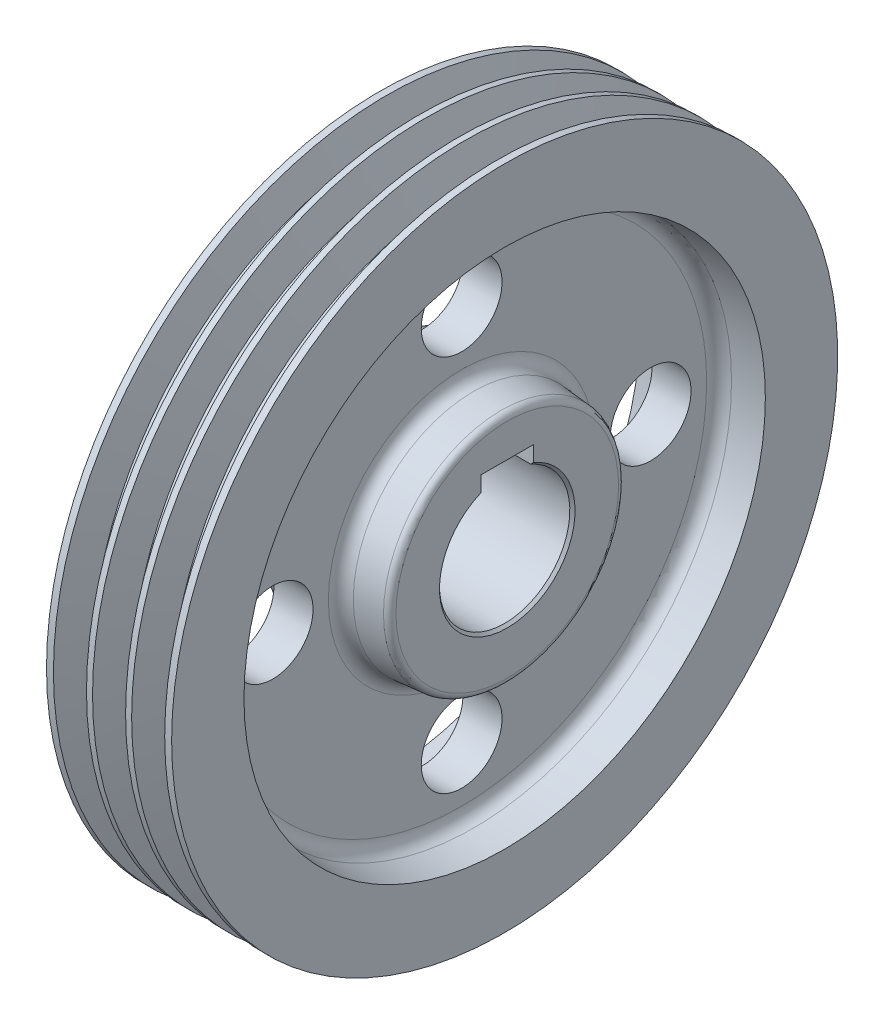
ISO-10303-21;
HEADER;
FILE_DESCRIPTION(('STEP AP214'),'2;1');
FILE_NAME('part.step','',(''),(''),'','','');
FILE_SCHEMA(('AUTOMOTIVE_DESIGN { 1 0 10303 214 1 1 1 1 }'));
ENDSEC;
DATA;
#1=APPLICATION_CONTEXT('core data for automotive mechanical design processes');
#2=APPLICATION_PROTOCOL_DEFINITION('international standard','automotive_design',2000,#1);
#3=PRODUCT_CONTEXT('',#1,'mechanical');
#4=PRODUCT('Part','Part','',(#3));
#5=PRODUCT_RELATED_PRODUCT_CATEGORY('part','',(#4));
#6=PRODUCT_DEFINITION_FORMATION('','',#4);
#7=PRODUCT_DEFINITION_CONTEXT('part definition',#1,'design');
#8=PRODUCT_DEFINITION('design','',#6,#7);
#9=PRODUCT_DEFINITION_SHAPE('','',#8);
#10=(LENGTH_UNIT() NAMED_UNIT(*) SI_UNIT(.MILLI.,.METRE.));
#11=(NAMED_UNIT(*) PLANE_ANGLE_UNIT() SI_UNIT($,.RADIAN.));
#12=(NAMED_UNIT(*) SI_UNIT($,.STERADIAN.) SOLID_ANGLE_UNIT());
#13=UNCERTAINTY_MEASURE_WITH_UNIT(LENGTH_MEASURE(1.E-05),#10,'distance_accuracy_value','');
#14=(GEOMETRIC_REPRESENTATION_CONTEXT(3) GLOBAL_UNCERTAINTY_ASSIGNED_CONTEXT((#13)) GLOBAL_UNIT_ASSIGNED_CONTEXT((#10,
#11,#12)) REPRESENTATION_CONTEXT('',''));
#15=CARTESIAN_POINT('',(0.,0.,0.));
#16=DIRECTION('',(0.,0.,1.));
#17=DIRECTION('',(1.,0.,0.));
#18=AXIS2_PLACEMENT_3D('',#15,#16,#17);
#19=CARTESIAN_POINT('',(16.5,46.5310516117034,0.));
#20=DIRECTION('',(1.,0.,0.));
#21=DIRECTION('',(0.,0.,-1.));
#22=AXIS2_PLACEMENT_3D('',#19,#20,#21);
#23=PLANE('',#22);
#24=CARTESIAN_POINT('',(16.5,-72.5,5.06265087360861E-13));
#25=DIRECTION('',(1.,0.,0.));
#26=DIRECTION('',(0.,0.,-1.));
#27=AXIS2_PLACEMENT_3D('',#24,#25,#26);
#28=CIRCLE('',#27,15.5);
#29=CARTESIAN_POINT('',(16.5,-72.5,-15.4999999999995));
#30=VERTEX_POINT('',#29);
#31=EDGE_CURVE('E327',#30,#30,#28,.F.);
#32=ORIENTED_EDGE('',*,*,#31,.F.);
#33=EDGE_LOOP('',(#32));
#34=FACE_BOUND('',#33,.T.);
#35=CARTESIAN_POINT('',(16.5,72.5,0.));
#36=DIRECTION('',(1.,0.,0.));
#37=DIRECTION('',(0.,0.,-1.));
#38=AXIS2_PLACEMENT_3D('',#35,#36,#37);
#39=CIRCLE('',#38,15.5);
#40=CARTESIAN_POINT('',(16.5,72.5,-15.5));
#41=VERTEX_POINT('',#40);
#42=EDGE_CURVE('E113',#41,#41,#39,.F.);
#43=ORIENTED_EDGE('',*,*,#42,.F.);
#44=EDGE_LOOP('',(#43));
#45=FACE_BOUND('',#44,.T.);
#46=CARTESIAN_POINT('',(16.5,0.,0.));
#47=DIRECTION('',(1.,0.,0.));
#48=DIRECTION('',(0.,0.,-1.));
#49=AXIS2_PLACEMENT_3D('',#46,#47,#48);
#50=CIRCLE('',#49,51.1127074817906);
#51=CARTESIAN_POINT('',(16.5,0.,-51.1127074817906));
#52=VERTEX_POINT('',#51);
#53=EDGE_CURVE('E293',#52,#52,#50,.T.);
#54=ORIENTED_EDGE('',*,*,#53,.T.);
#55=EDGE_LOOP('',(#54));
#56=FACE_BOUND('',#55,.T.);
#57=CARTESIAN_POINT('',(16.5,0.,0.));
#58=DIRECTION('',(1.,0.,0.));
#59=DIRECTION('',(0.,0.,-1.));
#60=AXIS2_PLACEMENT_3D('',#57,#58,#59);
#61=CIRCLE('',#60,93.9747811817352);
#62=CARTESIAN_POINT('',(16.5,0.,-93.9747811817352));
#63=VERTEX_POINT('',#62);
#64=EDGE_CURVE('E289',#63,#63,#61,.F.);
#65=ORIENTED_EDGE('',*,*,#64,.T.);
#66=EDGE_LOOP('',(#65));
#67=FACE_BOUND('',#66,.T.);
#68=CARTESIAN_POINT('',(16.5,-2.5313254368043E-13,-72.5));
#69=DIRECTION('',(1.,0.,0.));
#70=DIRECTION('',(0.,0.,-1.));
#71=AXIS2_PLACEMENT_3D('',#68,#69,#70);
#72=CIRCLE('',#71,15.5);
#73=CARTESIAN_POINT('',(16.5,-2.5313254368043E-13,-88.));
#74=VERTEX_POINT('',#73);
#75=EDGE_CURVE('E324',#74,#74,#72,.F.);
#76=ORIENTED_EDGE('',*,*,#75,.F.);
#77=EDGE_LOOP('',(#76));
#78=FACE_BOUND('',#77,.T.);
#79=CARTESIAN_POINT('',(16.5,7.59397631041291E-13,72.5));
#80=DIRECTION('',(1.,0.,0.));
#81=DIRECTION('',(0.,0.,-1.));
#82=AXIS2_PLACEMENT_3D('',#79,#80,#81);
#83=CIRCLE('',#82,15.5);
#84=CARTESIAN_POINT('',(16.5,7.59397631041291E-13,57.));
#85=VERTEX_POINT('',#84);
#86=EDGE_CURVE('E330',#85,#85,#83,.F.);
#87=ORIENTED_EDGE('',*,*,#86,.F.);
#88=EDGE_LOOP('',(#87));
#89=FACE_BOUND('',#88,.T.);
#90=ADVANCED_FACE('F30',(#34,#45,#56,#67,#78,#89),#23,.F.);
#91=CARTESIAN_POINT('',(31.5,98.5564370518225,0.));
#92=DIRECTION('',(-1.,0.,0.));
#93=DIRECTION('',(0.,0.,1.));
#94=AXIS2_PLACEMENT_3D('',#91,#92,#93);
#95=PLANE('',#94);
#96=CARTESIAN_POINT('',(31.5,-72.5,5.06265087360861E-13));
#97=DIRECTION('',(-1.,0.,0.));
#98=DIRECTION('',(0.,0.,1.));
#99=AXIS2_PLACEMENT_3D('',#96,#97,#98);
#100=CIRCLE('',#99,15.5);
#101=CARTESIAN_POINT('',(31.5,-72.5,15.5000000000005));
#102=VERTEX_POINT('',#101);
#103=EDGE_CURVE('E328',#102,#102,#100,.F.);
#104=ORIENTED_EDGE('',*,*,#103,.F.);
#105=EDGE_LOOP('',(#104));
#106=FACE_BOUND('',#105,.T.);
#107=CARTESIAN_POINT('',(31.5,72.5,0.));
#108=DIRECTION('',(-1.,0.,0.));
#109=DIRECTION('',(0.,0.,1.));
#110=AXIS2_PLACEMENT_3D('',#107,#108,#109);
#111=CIRCLE('',#110,15.5);
#112=CARTESIAN_POINT('',(31.5,72.5,15.5));
#113=VERTEX_POINT('',#112);
#114=EDGE_CURVE('E321',#113,#113,#111,.F.);
#115=ORIENTED_EDGE('',*,*,#114,.F.);
#116=EDGE_LOOP('',(#115));
#117=FACE_BOUND('',#116,.T.);
#118=CARTESIAN_POINT('',(31.5,0.,0.));
#119=DIRECTION('',(-1.,0.,0.));
#120=DIRECTION('',(0.,0.,1.));
#121=AXIS2_PLACEMENT_3D('',#118,#119,#120);
#122=CIRCLE('',#121,51.1127074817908);
#123=CARTESIAN_POINT('',(31.5,0.,51.1127074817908));
#124=VERTEX_POINT('',#123);
#125=EDGE_CURVE('E304',#124,#124,#122,.T.);
#126=ORIENTED_EDGE('',*,*,#125,.T.);
#127=EDGE_LOOP('',(#126));
#128=FACE_BOUND('',#127,.T.);
#129=CARTESIAN_POINT('',(31.5,0.,0.));
#130=DIRECTION('',(-1.,0.,0.));
#131=DIRECTION('',(0.,0.,1.));
#132=AXIS2_PLACEMENT_3D('',#129,#130,#131);
#133=CIRCLE('',#132,93.9747811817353);
#134=CARTESIAN_POINT('',(31.5,0.,93.9747811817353));
#135=VERTEX_POINT('',#134);
#136=EDGE_CURVE('E301',#135,#135,#133,.F.);
#137=ORIENTED_EDGE('',*,*,#136,.T.);
#138=EDGE_LOOP('',(#137));
#139=FACE_BOUND('',#138,.T.);
#140=CARTESIAN_POINT('',(31.5,-2.5313254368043E-13,-72.5));
#141=DIRECTION('',(-1.,0.,0.));
#142=DIRECTION('',(0.,0.,1.));
#143=AXIS2_PLACEMENT_3D('',#140,#141,#142);
#144=CIRCLE('',#143,15.5);
#145=CARTESIAN_POINT('',(31.5,-2.5313254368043E-13,-57.));
#146=VERTEX_POINT('',#145);
#147=EDGE_CURVE('E325',#146,#146,#144,.F.);
#148=ORIENTED_EDGE('',*,*,#147,.F.);
#149=EDGE_LOOP('',(#148));
#150=FACE_BOUND('',#149,.T.);
#151=CARTESIAN_POINT('',(31.5,7.59397631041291E-13,72.5));
#152=DIRECTION('',(-1.,0.,0.));
#153=DIRECTION('',(0.,0.,1.));
#154=AXIS2_PLACEMENT_3D('',#151,#152,#153);
#155=CIRCLE('',#154,15.5);
#156=CARTESIAN_POINT('',(31.5,7.59397631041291E-13,88.));
#157=VERTEX_POINT('',#156);
#158=EDGE_CURVE('E34',#157,#157,#155,.F.);
#159=ORIENTED_EDGE('',*,*,#158,.F.);
#160=EDGE_LOOP('',(#159));
#161=FACE_BOUND('',#160,.T.);
#162=ADVANCED_FACE('F190',(#106,#117,#128,#139,#150,#161),#95,.F.);
#163=CARTESIAN_POINT('',(0.,0.,0.));
#164=DIRECTION('',(-1.,0.,0.));
#165=DIRECTION('',(0.,0.,1.));
#166=AXIS2_PLACEMENT_3D('',#163,#164,#165);
#167=CYLINDRICAL_SURFACE('',#166,127.75);
#168=CARTESIAN_POINT('',(48.,0.,0.));
#169=DIRECTION('',(-1.,0.,0.));
#170=DIRECTION('',(0.,0.,1.));
#171=AXIS2_PLACEMENT_3D('',#168,#169,#170);
#172=CIRCLE('',#171,127.75);
#173=CARTESIAN_POINT('',(48.,0.,127.75));
#174=VERTEX_POINT('',#173);
#175=EDGE_CURVE('E242',#174,#174,#172,.T.);
#176=ORIENTED_EDGE('',*,*,#175,.T.);
#177=EDGE_LOOP('',(#176));
#178=FACE_BOUND('',#177,.T.);
#179=CARTESIAN_POINT('',(45.3407593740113,0.,0.));
#180=DIRECTION('',(-1.,0.,0.));
#181=DIRECTION('',(0.,0.,1.));
#182=AXIS2_PLACEMENT_3D('',#179,#180,#181);
#183=CIRCLE('',#182,127.75);
#184=CARTESIAN_POINT('',(45.3407593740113,0.,127.75));
#185=VERTEX_POINT('',#184);
#186=EDGE_CURVE('E275',#185,#185,#183,.T.);
#187=ORIENTED_EDGE('',*,*,#186,.F.);
#188=EDGE_LOOP('',(#187));
#189=FACE_BOUND('',#188,.T.);
#190=ADVANCED_FACE('F196',(#178,#189),#167,.T.);
#191=CARTESIAN_POINT('',(30.3407593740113,0.,0.));
#192=DIRECTION('',(-1.,0.,0.));
#193=DIRECTION('',(0.,0.,1.));
#194=AXIS2_PLACEMENT_3D('',#191,#192,#193);
#195=CIRCLE('',#194,127.75);
#196=CARTESIAN_POINT('',(30.3407593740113,0.,127.75));
#197=VERTEX_POINT('',#196);
#198=EDGE_CURVE('E263',#197,#197,#195,.T.);
#199=ORIENTED_EDGE('',*,*,#198,.F.);
#200=EDGE_LOOP('',(#199));
#201=FACE_BOUND('',#200,.T.);
#202=CARTESIAN_POINT('',(32.6592406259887,0.,0.));
#203=DIRECTION('',(-1.,0.,0.));
#204=DIRECTION('',(0.,0.,1.));
#205=AXIS2_PLACEMENT_3D('',#202,#203,#204);
#206=CIRCLE('',#205,127.75);
#207=CARTESIAN_POINT('',(32.6592406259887,0.,127.75));
#208=VERTEX_POINT('',#207);
#209=EDGE_CURVE('E278',#208,#208,#206,.T.);
#210=ORIENTED_EDGE('',*,*,#209,.T.);
#211=EDGE_LOOP('',(#210));
#212=FACE_BOUND('',#211,.T.);
#213=ADVANCED_FACE('F596',(#201,#212),#167,.T.);
#214=CARTESIAN_POINT('',(15.3407593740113,0.,0.));
#215=DIRECTION('',(-1.,0.,0.));
#216=DIRECTION('',(0.,0.,1.));
#217=AXIS2_PLACEMENT_3D('',#214,#215,#216);
#218=CIRCLE('',#217,127.75);
#219=CARTESIAN_POINT('',(15.3407593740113,0.,127.75));
#220=VERTEX_POINT('',#219);
#221=EDGE_CURVE('E251',#220,#220,#218,.T.);
#222=ORIENTED_EDGE('',*,*,#221,.F.);
#223=EDGE_LOOP('',(#222));
#224=FACE_BOUND('',#223,.T.);
#225=CARTESIAN_POINT('',(17.6592406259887,0.,0.));
#226=DIRECTION('',(-1.,0.,0.));
#227=DIRECTION('',(0.,0.,1.));
#228=AXIS2_PLACEMENT_3D('',#225,#226,#227);
#229=CIRCLE('',#228,127.75);
#230=CARTESIAN_POINT('',(17.6592406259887,0.,127.75));
#231=VERTEX_POINT('',#230);
#232=EDGE_CURVE('E266',#231,#231,#229,.T.);
#233=ORIENTED_EDGE('',*,*,#232,.T.);
#234=EDGE_LOOP('',(#233));
#235=FACE_BOUND('',#234,.T.);
#236=ADVANCED_FACE('F219',(#224,#235),#167,.T.);
#237=CARTESIAN_POINT('',(0.,0.,0.));
#238=DIRECTION('',(-1.,0.,0.));
#239=DIRECTION('',(0.,0.,1.));
#240=AXIS2_PLACEMENT_3D('',#237,#238,#239);
#241=CIRCLE('',#240,127.75);
#242=CARTESIAN_POINT('',(0.,0.,127.75));
#243=VERTEX_POINT('',#242);
#244=EDGE_CURVE('E239',#243,#243,#241,.T.);
#245=ORIENTED_EDGE('',*,*,#244,.F.);
#246=EDGE_LOOP('',(#245));
#247=FACE_BOUND('',#246,.T.);
#248=CARTESIAN_POINT('',(2.65924062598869,0.,0.));
#249=DIRECTION('',(-1.,0.,0.));
#250=DIRECTION('',(0.,0.,1.));
#251=AXIS2_PLACEMENT_3D('',#248,#249,#250);
#252=CIRCLE('',#251,127.75);
#253=CARTESIAN_POINT('',(2.65924062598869,0.,127.75));
#254=VERTEX_POINT('',#253);
#255=EDGE_CURVE('E254',#254,#254,#252,.T.);
#256=ORIENTED_EDGE('',*,*,#255,.T.);
#257=EDGE_LOOP('',(#256));
#258=FACE_BOUND('',#257,.T.);
#259=ADVANCED_FACE('F214',(#247,#258),#167,.T.);
#260=CARTESIAN_POINT('',(0.,0.,0.));
#261=DIRECTION('',(-1.,0.,0.));
#262=DIRECTION('',(0.,0.,1.));
#263=AXIS2_PLACEMENT_3D('',#260,#261,#262);
#264=CYLINDRICAL_SURFACE('',#263,25.);
#265=CARTESIAN_POINT('',(0.,0.,0.));
#266=DIRECTION('',(1.,0.,0.));
#267=DIRECTION('',(0.,0.,-1.));
#268=AXIS2_PLACEMENT_3D('',#265,#266,#267);
#269=CIRCLE('',#268,25.);
#270=CARTESIAN_POINT('',(0.,22.9128784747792,-10.));
#271=VERTEX_POINT('',#270);
#272=CARTESIAN_POINT('',(0.,22.9128784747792,10.));
#273=VERTEX_POINT('',#272);
#274=EDGE_CURVE('E225',#271,#273,#269,.F.);
#275=ORIENTED_EDGE('',*,*,#274,.T.);
#276=DIRECTION('',(-1.,0.,0.));
#277=VECTOR('',#276,1.);
#278=CARTESIAN_POINT('',(49.,22.9128784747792,10.));
#279=LINE('',#278,#277);
#280=CARTESIAN_POINT('',(48.,22.9128784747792,10.));
#281=VERTEX_POINT('',#280);
#282=EDGE_CURVE('E92',#281,#273,#279,.T.);
#283=ORIENTED_EDGE('',*,*,#282,.F.);
#284=CARTESIAN_POINT('',(48.,0.,0.));
#285=DIRECTION('',(-1.,0.,0.));
#286=DIRECTION('',(0.,0.,1.));
#287=AXIS2_PLACEMENT_3D('',#284,#285,#286);
#288=CIRCLE('',#287,25.);
#289=CARTESIAN_POINT('',(48.,22.9128784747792,-10.));
#290=VERTEX_POINT('',#289);
#291=EDGE_CURVE('E231',#281,#290,#288,.F.);
#292=ORIENTED_EDGE('',*,*,#291,.T.);
#293=DIRECTION('',(-1.,0.,0.));
#294=VECTOR('',#293,1.);
#295=CARTESIAN_POINT('',(49.,22.9128784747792,-10.));
#296=LINE('',#295,#294);
#297=EDGE_CURVE('E100',#290,#271,#296,.T.);
#298=ORIENTED_EDGE('',*,*,#297,.T.);
#299=EDGE_LOOP('',(#275,#283,#292,#298));
#300=FACE_BOUND('',#299,.T.);
#301=ADVANCED_FACE('F211',(#300),#264,.F.);
#302=CARTESIAN_POINT('',(-1.,25.,0.));
#303=DIRECTION('',(1.,0.,0.));
#304=DIRECTION('',(0.,0.,-1.));
#305=AXIS2_PLACEMENT_3D('',#302,#303,#304);
#306=PLANE('',#305);
#307=CARTESIAN_POINT('',(-1.,0.,0.));
#308=DIRECTION('',(1.,0.,0.));
#309=DIRECTION('',(0.,0.,-1.));
#310=AXIS2_PLACEMENT_3D('',#307,#308,#309);
#311=CIRCLE('',#310,42.7091720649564);
#312=CARTESIAN_POINT('',(-1.,0.,-42.7091720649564));
#313=VERTEX_POINT('',#312);
#314=EDGE_CURVE('E39',#313,#313,#311,.F.);
#315=ORIENTED_EDGE('',*,*,#314,.T.);
#316=EDGE_LOOP('',(#315));
#317=FACE_BOUND('',#316,.T.);
#318=CARTESIAN_POINT('',(-1.,0.,0.));
#319=DIRECTION('',(1.,0.,0.));
#320=DIRECTION('',(0.,0.,-1.));
#321=AXIS2_PLACEMENT_3D('',#318,#319,#320);
#322=CIRCLE('',#321,26.);
#323=CARTESIAN_POINT('',(-1.,24.,10.));
#324=VERTEX_POINT('',#323);
#325=CARTESIAN_POINT('',(-1.,24.,-10.));
#326=VERTEX_POINT('',#325);
#327=EDGE_CURVE('E230',#324,#326,#322,.T.);
#328=ORIENTED_EDGE('',*,*,#327,.T.);
#329=DIRECTION('',(0.,-1.,0.));
#330=VECTOR('',#329,1.);
#331=CARTESIAN_POINT('',(-1.,22.9128784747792,-10.));
#332=LINE('',#331,#330);
#333=CARTESIAN_POINT('',(-1.,29.9,-10.));
#334=VERTEX_POINT('',#333);
#335=EDGE_CURVE('E55',#334,#326,#332,.T.);
#336=ORIENTED_EDGE('',*,*,#335,.F.);
#337=DIRECTION('',(0.,0.,-1.));
#338=VECTOR('',#337,1.);
#339=CARTESIAN_POINT('',(-1.,29.9,-10.));
#340=LINE('',#339,#338);
#341=CARTESIAN_POINT('',(-1.,29.9,10.));
#342=VERTEX_POINT('',#341);
#343=EDGE_CURVE('E108',#342,#334,#340,.T.);
#344=ORIENTED_EDGE('',*,*,#343,.F.);
#345=DIRECTION('',(0.,1.,0.));
#346=VECTOR('',#345,1.);
#347=CARTESIAN_POINT('',(-1.,22.9128784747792,10.));
#348=LINE('',#347,#346);
#349=EDGE_CURVE('E87',#324,#342,#348,.T.);
#350=ORIENTED_EDGE('',*,*,#349,.F.);
#351=EDGE_LOOP('',(#328,#336,#344,#350));
#352=FACE_BOUND('',#351,.T.);
#353=ADVANCED_FACE('F208',(#317,#352),#306,.F.);
#354=CARTESIAN_POINT('',(16.5,0.,0.));
#355=DIRECTION('',(1.,0.,0.));
#356=DIRECTION('',(0.,0.,-1.));
#357=AXIS2_PLACEMENT_3D('',#354,#355,#356);
#358=CONICAL_SURFACE('',#357,46.5310516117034,0.0872664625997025);
#359=CARTESIAN_POINT('',(1.28211064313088,0.,0.));
#360=DIRECTION('',(-1.,0.,0.));
#361=DIRECTION('',(0.,0.,1.));
#362=AXIS2_PLACEMENT_3D('',#359,#360,#361);
#363=CIRCLE('',#362,45.1996588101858);
#364=CARTESIAN_POINT('',(1.28211064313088,0.,45.1996588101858));
#365=VERTEX_POINT('',#364);
#366=EDGE_CURVE('E11',#365,#365,#363,.F.);
#367=ORIENTED_EDGE('',*,*,#366,.T.);
#368=EDGE_LOOP('',(#367));
#369=FACE_BOUND('',#368,.T.);
#370=CARTESIAN_POINT('',(11.9357787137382,0.,0.));
#371=DIRECTION('',(1.,0.,0.));
#372=DIRECTION('',(0.,0.,-1.));
#373=AXIS2_PLACEMENT_3D('',#370,#371,#372);
#374=CIRCLE('',#373,46.1317339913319);
#375=CARTESIAN_POINT('',(11.9357787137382,0.,-46.1317339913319));
#376=VERTEX_POINT('',#375);
#377=EDGE_CURVE('E287',#376,#376,#374,.F.);
#378=ORIENTED_EDGE('',*,*,#377,.T.);
#379=EDGE_LOOP('',(#378));
#380=FACE_BOUND('',#379,.T.);
#381=ADVANCED_FACE('F205',(#369,#380),#358,.T.);
#382=CARTESIAN_POINT('',(0.,0.,0.));
#383=DIRECTION('',(-1.,0.,0.));
#384=DIRECTION('',(0.,0.,1.));
#385=AXIS2_PLACEMENT_3D('',#382,#383,#384);
#386=CONICAL_SURFACE('',#385,100.,0.0872664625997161);
#387=CARTESIAN_POINT('',(11.9357787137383,0.,0.));
#388=DIRECTION('',(-1.,0.,0.));
#389=DIRECTION('',(0.,0.,1.));
#390=AXIS2_PLACEMENT_3D('',#387,#388,#389);
#391=CIRCLE('',#390,98.9557546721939);
#392=CARTESIAN_POINT('',(11.9357787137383,0.,98.9557546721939));
#393=VERTEX_POINT('',#392);
#394=EDGE_CURVE('E298',#393,#393,#391,.F.);
#395=ORIENTED_EDGE('',*,*,#394,.T.);
#396=EDGE_LOOP('',(#395));
#397=FACE_BOUND('',#396,.T.);
#398=CARTESIAN_POINT('',(0.,0.,0.));
#399=DIRECTION('',(-1.,0.,0.));
#400=DIRECTION('',(0.,0.,1.));
#401=AXIS2_PLACEMENT_3D('',#398,#399,#400);
#402=CIRCLE('',#401,100.);
#403=CARTESIAN_POINT('',(0.,0.,100.));
#404=VERTEX_POINT('',#403);
#405=EDGE_CURVE('E234',#404,#404,#402,.T.);
#406=ORIENTED_EDGE('',*,*,#405,.T.);
#407=EDGE_LOOP('',(#406));
#408=FACE_BOUND('',#407,.T.);
#409=ADVANCED_FACE('F203',(#397,#408),#386,.F.);
#410=CARTESIAN_POINT('',(0.,100.,0.));
#411=DIRECTION('',(1.,0.,0.));
#412=DIRECTION('',(0.,0.,-1.));
#413=AXIS2_PLACEMENT_3D('',#410,#411,#412);
#414=PLANE('',#413);
#415=ORIENTED_EDGE('',*,*,#405,.F.);
#416=EDGE_LOOP('',(#415));
#417=FACE_BOUND('',#416,.T.);
#418=ORIENTED_EDGE('',*,*,#244,.T.);
#419=EDGE_LOOP('',(#418));
#420=FACE_BOUND('',#419,.T.);
#421=ADVANCED_FACE('F489',(#417,#420),#414,.F.);
#422=CARTESIAN_POINT('',(48.,127.75,0.));
#423=DIRECTION('',(-1.,0.,0.));
#424=DIRECTION('',(0.,0.,1.));
#425=AXIS2_PLACEMENT_3D('',#422,#423,#424);
#426=PLANE('',#425);
#427=ORIENTED_EDGE('',*,*,#175,.F.);
#428=EDGE_LOOP('',(#427));
#429=FACE_BOUND('',#428,.T.);
#430=CARTESIAN_POINT('',(48.,0.,0.));
#431=DIRECTION('',(-1.,0.,0.));
#432=DIRECTION('',(0.,0.,1.));
#433=AXIS2_PLACEMENT_3D('',#430,#431,#432);
#434=CIRCLE('',#433,100.);
#435=CARTESIAN_POINT('',(48.,0.,100.));
#436=VERTEX_POINT('',#435);
#437=EDGE_CURVE('E245',#436,#436,#434,.T.);
#438=ORIENTED_EDGE('',*,*,#437,.T.);
#439=EDGE_LOOP('',(#438));
#440=FACE_BOUND('',#439,.T.);
#441=ADVANCED_FACE('F479',(#429,#440),#426,.F.);
#442=CARTESIAN_POINT('',(31.5,0.,0.));
#443=DIRECTION('',(1.,0.,0.));
#444=DIRECTION('',(0.,0.,-1.));
#445=AXIS2_PLACEMENT_3D('',#442,#443,#444);
#446=CONICAL_SURFACE('',#445,98.5564370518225,0.0872664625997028);
#447=CARTESIAN_POINT('',(36.0642212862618,0.,0.));
#448=DIRECTION('',(1.,0.,0.));
#449=DIRECTION('',(0.,0.,-1.));
#450=AXIS2_PLACEMENT_3D('',#447,#448,#449);
#451=CIRCLE('',#450,98.9557546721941);
#452=CARTESIAN_POINT('',(36.0642212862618,0.,-98.9557546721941));
#453=VERTEX_POINT('',#452);
#454=EDGE_CURVE('E310',#453,#453,#451,.F.);
#455=ORIENTED_EDGE('',*,*,#454,.T.);
#456=EDGE_LOOP('',(#455));
#457=FACE_BOUND('',#456,.T.);
#458=ORIENTED_EDGE('',*,*,#437,.F.);
#459=EDGE_LOOP('',(#458));
#460=FACE_BOUND('',#459,.T.);
#461=ADVANCED_FACE('F430',(#457,#460),#446,.F.);
#462=CARTESIAN_POINT('',(49.,0.,0.));
#463=DIRECTION('',(-1.,0.,0.));
#464=DIRECTION('',(0.,0.,1.));
#465=AXIS2_PLACEMENT_3D('',#462,#463,#464);
#466=CONICAL_SURFACE('',#465,45.,0.0872664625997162);
#467=CARTESIAN_POINT('',(46.7178893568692,0.,0.));
#468=DIRECTION('',(1.,0.,0.));
#469=DIRECTION('',(0.,0.,-1.));
#470=AXIS2_PLACEMENT_3D('',#467,#468,#469);
#471=CIRCLE('',#470,45.1996588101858);
#472=CARTESIAN_POINT('',(46.7178893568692,0.,-45.1996588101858));
#473=VERTEX_POINT('',#472);
#474=EDGE_CURVE('E313',#473,#473,#471,.F.);
#475=ORIENTED_EDGE('',*,*,#474,.T.);
#476=EDGE_LOOP('',(#475));
#477=FACE_BOUND('',#476,.T.);
#478=CARTESIAN_POINT('',(36.0642212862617,0.,0.));
#479=DIRECTION('',(-1.,0.,0.));
#480=DIRECTION('',(0.,0.,1.));
#481=AXIS2_PLACEMENT_3D('',#478,#479,#480);
#482=CIRCLE('',#481,46.1317339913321);
#483=CARTESIAN_POINT('',(36.0642212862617,0.,46.1317339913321));
#484=VERTEX_POINT('',#483);
#485=EDGE_CURVE('E307',#484,#484,#482,.F.);
#486=ORIENTED_EDGE('',*,*,#485,.T.);
#487=EDGE_LOOP('',(#486));
#488=FACE_BOUND('',#487,.T.);
#489=ADVANCED_FACE('F418',(#477,#488),#466,.T.);
#490=CARTESIAN_POINT('',(49.,45.,0.));
#491=DIRECTION('',(-1.,0.,0.));
#492=DIRECTION('',(0.,0.,1.));
#493=AXIS2_PLACEMENT_3D('',#490,#491,#492);
#494=PLANE('',#493);
#495=CARTESIAN_POINT('',(49.,0.,0.));
#496=DIRECTION('',(-1.,0.,0.));
#497=DIRECTION('',(0.,0.,1.));
#498=AXIS2_PLACEMENT_3D('',#495,#496,#497);
#499=CIRCLE('',#498,42.7091720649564);
#500=CARTESIAN_POINT('',(49.,0.,42.7091720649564));
#501=VERTEX_POINT('',#500);
#502=EDGE_CURVE('E316',#501,#501,#499,.F.);
#503=ORIENTED_EDGE('',*,*,#502,.T.);
#504=EDGE_LOOP('',(#503));
#505=FACE_BOUND('',#504,.T.);
#506=DIRECTION('',(0.,0.,-1.));
#507=VECTOR('',#506,1.);
#508=CARTESIAN_POINT('',(49.,29.9,-10.));
#509=LINE('',#508,#507);
#510=CARTESIAN_POINT('',(49.,29.9,10.));
#511=VERTEX_POINT('',#510);
#512=CARTESIAN_POINT('',(49.,29.9,-10.));
#513=VERTEX_POINT('',#512);
#514=EDGE_CURVE('E95',#511,#513,#509,.T.);
#515=ORIENTED_EDGE('',*,*,#514,.T.);
#516=DIRECTION('',(0.,-1.,0.));
#517=VECTOR('',#516,1.);
#518=CARTESIAN_POINT('',(49.,22.9128784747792,-10.));
#519=LINE('',#518,#517);
#520=CARTESIAN_POINT('',(49.,23.9999999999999,-10.));
#521=VERTEX_POINT('',#520);
#522=EDGE_CURVE('E106',#513,#521,#519,.T.);
#523=ORIENTED_EDGE('',*,*,#522,.T.);
#524=CARTESIAN_POINT('',(49.,0.,0.));
#525=DIRECTION('',(-1.,0.,0.));
#526=DIRECTION('',(0.,0.,1.));
#527=AXIS2_PLACEMENT_3D('',#524,#525,#526);
#528=CIRCLE('',#527,25.9999999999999);
#529=CARTESIAN_POINT('',(49.,23.9999999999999,10.));
#530=VERTEX_POINT('',#529);
#531=EDGE_CURVE('E105',#521,#530,#528,.T.);
#532=ORIENTED_EDGE('',*,*,#531,.T.);
#533=DIRECTION('',(0.,1.,0.));
#534=VECTOR('',#533,1.);
#535=CARTESIAN_POINT('',(49.,22.9128784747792,10.));
#536=LINE('',#535,#534);
#537=EDGE_CURVE('E47',#530,#511,#536,.T.);
#538=ORIENTED_EDGE('',*,*,#537,.T.);
#539=EDGE_LOOP('',(#515,#523,#532,#538));
#540=FACE_BOUND('',#539,.T.);
#541=ADVANCED_FACE('F103',(#505,#540),#494,.F.);
#542=CARTESIAN_POINT('',(0.,0.,0.));
#543=DIRECTION('',(-1.,0.,0.));
#544=DIRECTION('',(0.,0.,1.));
#545=AXIS2_PLACEMENT_3D('',#542,#543,#544);
#546=CYLINDRICAL_SURFACE('',#545,116.3);
#547=CARTESIAN_POINT('',(11.8401430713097,0.,0.));
#548=DIRECTION('',(-1.,0.,0.));
#549=DIRECTION('',(0.,0.,1.));
#550=AXIS2_PLACEMENT_3D('',#547,#548,#549);
#551=CIRCLE('',#550,116.3);
#552=CARTESIAN_POINT('',(11.8401430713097,0.,116.3));
#553=VERTEX_POINT('',#552);
#554=EDGE_CURVE('E248',#553,#553,#551,.T.);
#555=ORIENTED_EDGE('',*,*,#554,.T.);
#556=EDGE_LOOP('',(#555));
#557=FACE_BOUND('',#556,.T.);
#558=CARTESIAN_POINT('',(6.15985692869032,0.,0.));
#559=DIRECTION('',(-1.,0.,0.));
#560=DIRECTION('',(0.,0.,1.));
#561=AXIS2_PLACEMENT_3D('',#558,#559,#560);
#562=CIRCLE('',#561,116.3);
#563=CARTESIAN_POINT('',(6.15985692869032,0.,116.3));
#564=VERTEX_POINT('',#563);
#565=EDGE_CURVE('E257',#564,#564,#562,.T.);
#566=ORIENTED_EDGE('',*,*,#565,.F.);
#567=EDGE_LOOP('',(#566));
#568=FACE_BOUND('',#567,.T.);
#569=ADVANCED_FACE('F417',(#557,#568),#546,.T.);
#570=CARTESIAN_POINT('',(11.8401430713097,0.,0.));
#571=DIRECTION('',(1.,0.,0.));
#572=DIRECTION('',(0.,0.,-1.));
#573=AXIS2_PLACEMENT_3D('',#570,#571,#572);
#574=CONICAL_SURFACE('',#573,116.3,1.27409035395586);
#575=ORIENTED_EDGE('',*,*,#221,.T.);
#576=EDGE_LOOP('',(#575));
#577=FACE_BOUND('',#576,.T.);
#578=ORIENTED_EDGE('',*,*,#554,.F.);
#579=EDGE_LOOP('',(#578));
#580=FACE_BOUND('',#579,.T.);
#581=ADVANCED_FACE('F618',(#577,#580),#574,.T.);
#582=CARTESIAN_POINT('',(2.65924062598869,0.,0.));
#583=DIRECTION('',(-1.,0.,0.));
#584=DIRECTION('',(0.,0.,1.));
#585=AXIS2_PLACEMENT_3D('',#582,#583,#584);
#586=CONICAL_SURFACE('',#585,127.75,1.27409035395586);
#587=ORIENTED_EDGE('',*,*,#565,.T.);
#588=EDGE_LOOP('',(#587));
#589=FACE_BOUND('',#588,.T.);
#590=ORIENTED_EDGE('',*,*,#255,.F.);
#591=EDGE_LOOP('',(#590));
#592=FACE_BOUND('',#591,.T.);
#593=ADVANCED_FACE('F584',(#589,#592),#586,.T.);
#594=CARTESIAN_POINT('',(15.,0.,0.));
#595=DIRECTION('',(-1.,0.,0.));
#596=DIRECTION('',(0.,0.,1.));
#597=AXIS2_PLACEMENT_3D('',#594,#595,#596);
#598=CYLINDRICAL_SURFACE('',#597,116.3);
#599=CARTESIAN_POINT('',(26.8401430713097,0.,0.));
#600=DIRECTION('',(-1.,0.,0.));
#601=DIRECTION('',(0.,0.,1.));
#602=AXIS2_PLACEMENT_3D('',#599,#600,#601);
#603=CIRCLE('',#602,116.3);
#604=CARTESIAN_POINT('',(26.8401430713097,0.,116.3));
#605=VERTEX_POINT('',#604);
#606=EDGE_CURVE('E260',#605,#605,#603,.T.);
#607=ORIENTED_EDGE('',*,*,#606,.T.);
#608=EDGE_LOOP('',(#607));
#609=FACE_BOUND('',#608,.T.);
#610=CARTESIAN_POINT('',(21.1598569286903,0.,0.));
#611=DIRECTION('',(-1.,0.,0.));
#612=DIRECTION('',(0.,0.,1.));
#613=AXIS2_PLACEMENT_3D('',#610,#611,#612);
#614=CIRCLE('',#613,116.3);
#615=CARTESIAN_POINT('',(21.1598569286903,0.,116.3));
#616=VERTEX_POINT('',#615);
#617=EDGE_CURVE('E269',#616,#616,#614,.T.);
#618=ORIENTED_EDGE('',*,*,#617,.F.);
#619=EDGE_LOOP('',(#618));
#620=FACE_BOUND('',#619,.T.);
#621=ADVANCED_FACE('F574',(#609,#620),#598,.T.);
#622=CARTESIAN_POINT('',(26.8401430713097,0.,0.));
#623=DIRECTION('',(1.,0.,0.));
#624=DIRECTION('',(0.,0.,-1.));
#625=AXIS2_PLACEMENT_3D('',#622,#623,#624);
#626=CONICAL_SURFACE('',#625,116.3,1.27409035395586);
#627=ORIENTED_EDGE('',*,*,#198,.T.);
#628=EDGE_LOOP('',(#627));
#629=FACE_BOUND('',#628,.T.);
#630=ORIENTED_EDGE('',*,*,#606,.F.);
#631=EDGE_LOOP('',(#630));
#632=FACE_BOUND('',#631,.T.);
#633=ADVANCED_FACE('F564',(#629,#632),#626,.T.);
#634=CARTESIAN_POINT('',(17.6592406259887,0.,0.));
#635=DIRECTION('',(-1.,0.,0.));
#636=DIRECTION('',(0.,0.,1.));
#637=AXIS2_PLACEMENT_3D('',#634,#635,#636);
#638=CONICAL_SURFACE('',#637,127.75,1.27409035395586);
#639=ORIENTED_EDGE('',*,*,#617,.T.);
#640=EDGE_LOOP('',(#639));
#641=FACE_BOUND('',#640,.T.);
#642=ORIENTED_EDGE('',*,*,#232,.F.);
#643=EDGE_LOOP('',(#642));
#644=FACE_BOUND('',#643,.T.);
#645=ADVANCED_FACE('F554',(#641,#644),#638,.T.);
#646=CARTESIAN_POINT('',(30.,0.,0.));
#647=DIRECTION('',(-1.,0.,0.));
#648=DIRECTION('',(0.,0.,1.));
#649=AXIS2_PLACEMENT_3D('',#646,#647,#648);
#650=CYLINDRICAL_SURFACE('',#649,116.3);
#651=CARTESIAN_POINT('',(41.8401430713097,0.,0.));
#652=DIRECTION('',(-1.,0.,0.));
#653=DIRECTION('',(0.,0.,1.));
#654=AXIS2_PLACEMENT_3D('',#651,#652,#653);
#655=CIRCLE('',#654,116.3);
#656=CARTESIAN_POINT('',(41.8401430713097,0.,116.3));
#657=VERTEX_POINT('',#656);
#658=EDGE_CURVE('E272',#657,#657,#655,.T.);
#659=ORIENTED_EDGE('',*,*,#658,.T.);
#660=EDGE_LOOP('',(#659));
#661=FACE_BOUND('',#660,.T.);
#662=CARTESIAN_POINT('',(36.1598569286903,0.,0.));
#663=DIRECTION('',(-1.,0.,0.));
#664=DIRECTION('',(0.,0.,1.));
#665=AXIS2_PLACEMENT_3D('',#662,#663,#664);
#666=CIRCLE('',#665,116.3);
#667=CARTESIAN_POINT('',(36.1598569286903,0.,116.3));
#668=VERTEX_POINT('',#667);
#669=EDGE_CURVE('E280',#668,#668,#666,.T.);
#670=ORIENTED_EDGE('',*,*,#669,.F.);
#671=EDGE_LOOP('',(#670));
#672=FACE_BOUND('',#671,.T.);
#673=ADVANCED_FACE('F544',(#661,#672),#650,.T.);
#674=CARTESIAN_POINT('',(41.8401430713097,0.,0.));
#675=DIRECTION('',(1.,0.,0.));
#676=DIRECTION('',(0.,0.,-1.));
#677=AXIS2_PLACEMENT_3D('',#674,#675,#676);
#678=CONICAL_SURFACE('',#677,116.3,1.27409035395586);
#679=ORIENTED_EDGE('',*,*,#186,.T.);
#680=EDGE_LOOP('',(#679));
#681=FACE_BOUND('',#680,.T.);
#682=ORIENTED_EDGE('',*,*,#658,.F.);
#683=EDGE_LOOP('',(#682));
#684=FACE_BOUND('',#683,.T.);
#685=ADVANCED_FACE('F536',(#681,#684),#678,.T.);
#686=CARTESIAN_POINT('',(32.6592406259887,0.,0.));
#687=DIRECTION('',(-1.,0.,0.));
#688=DIRECTION('',(0.,0.,1.));
#689=AXIS2_PLACEMENT_3D('',#686,#687,#688);
#690=CONICAL_SURFACE('',#689,127.75,1.27409035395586);
#691=ORIENTED_EDGE('',*,*,#669,.T.);
#692=EDGE_LOOP('',(#691));
#693=FACE_BOUND('',#692,.T.);
#694=ORIENTED_EDGE('',*,*,#209,.F.);
#695=EDGE_LOOP('',(#694));
#696=FACE_BOUND('',#695,.T.);
#697=ADVANCED_FACE('F524',(#693,#696),#690,.T.);
#698=CARTESIAN_POINT('',(0.,0.,0.));
#699=DIRECTION('',(-1.,0.,0.));
#700=DIRECTION('',(0.,0.,1.));
#701=AXIS2_PLACEMENT_3D('',#698,#699,#700);
#702=CONICAL_SURFACE('',#701,25.,0.785398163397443);
#703=CARTESIAN_POINT('',(-4.72508401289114,27.9925100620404,-10.));
#704=CARTESIAN_POINT('',(-4.36428615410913,27.6093773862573,-10.));
#705=CARTESIAN_POINT('',(-4.00392869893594,27.2258304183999,-10.));
#706=CARTESIAN_POINT('',(-3.28421704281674,26.4577950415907,-10.));
#707=CARTESIAN_POINT('',(-2.92486284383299,26.0733066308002,-10.));
#708=CARTESIAN_POINT('',(-1.84853772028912,24.918312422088,-10.));
#709=CARTESIAN_POINT('',(-1.13325717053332,24.1462276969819,-10.));
#710=CARTESIAN_POINT('',(-0.0647538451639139,22.9840156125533,-10.));
#711=CARTESIAN_POINT('',(0.290683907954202,22.5959238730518,-10.));
#712=CARTESIAN_POINT('',(0.999845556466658,21.818178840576,-10.));
#713=CARTESIAN_POINT('',(1.35356945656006,21.4285255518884,-10.));
#714=CARTESIAN_POINT('',(2.05905479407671,20.6474008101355,-10.));
#715=CARTESIAN_POINT('',(2.41081610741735,20.2559292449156,-10.));
#716=CARTESIAN_POINT('',(3.11199783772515,19.4708888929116,-10.));
#717=CARTESIAN_POINT('',(3.46141823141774,19.0773200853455,-10.));
#718=CARTESIAN_POINT('',(3.80948660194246,18.6825549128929,-10.));
#719=B_SPLINE_CURVE_WITH_KNOTS('',3,(#703,#704,#705,#706,#707,#708,#709,#710,#711,#712,#713,
#714,#715,#716,#717,#718),.UNSPECIFIED.,.F.,.F.,(4,2,2,2,2,2,2,4),(0.,1.57882482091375,
3.15765272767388,6.31510258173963,7.89388318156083,9.47265945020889,11.0515344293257,
12.6304250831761),.UNSPECIFIED.);
#720=EDGE_CURVE('E127',#326,#271,#719,.T.);
#721=ORIENTED_EDGE('',*,*,#720,.F.);
#722=ORIENTED_EDGE('',*,*,#327,.F.);
#723=CARTESIAN_POINT('',(3.80948660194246,18.6825549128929,10.));
#724=CARTESIAN_POINT('',(3.46141823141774,19.0773200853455,10.));
#725=CARTESIAN_POINT('',(3.11199783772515,19.4708888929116,10.));
#726=CARTESIAN_POINT('',(2.41081610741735,20.2559292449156,10.));
#727=CARTESIAN_POINT('',(2.05905479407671,20.6474008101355,10.));
#728=CARTESIAN_POINT('',(1.35356945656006,21.4285255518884,10.));
#729=CARTESIAN_POINT('',(0.999845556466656,21.818178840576,10.));
#730=CARTESIAN_POINT('',(0.290683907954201,22.5959238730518,10.));
#731=CARTESIAN_POINT('',(-0.0647538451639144,22.9840156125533,10.));
#732=CARTESIAN_POINT('',(-1.13325717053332,24.1462276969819,10.));
#733=CARTESIAN_POINT('',(-1.84853772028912,24.9183124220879,10.));
#734=CARTESIAN_POINT('',(-2.92486284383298,26.0733066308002,10.));
#735=CARTESIAN_POINT('',(-3.28421704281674,26.4577950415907,10.));
#736=CARTESIAN_POINT('',(-4.00392869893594,27.2258304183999,10.));
#737=CARTESIAN_POINT('',(-4.36428615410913,27.6093773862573,10.));
#738=CARTESIAN_POINT('',(-4.72508401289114,27.9925100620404,10.));
#739=B_SPLINE_CURVE_WITH_KNOTS('',3,(#723,#724,#725,#726,#727,#728,#729,#730,#731,#732,#733,
#734,#735,#736,#737,#738),.UNSPECIFIED.,.F.,.F.,(4,2,2,2,2,2,2,4),(0.,1.57889065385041,
3.1577656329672,4.73654190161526,6.31532250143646,9.4727723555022,11.0516002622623,
12.6304250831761),.UNSPECIFIED.);
#740=EDGE_CURVE('E116',#273,#324,#739,.T.);
#741=ORIENTED_EDGE('',*,*,#740,.F.);
#742=ORIENTED_EDGE('',*,*,#274,.F.);
#743=EDGE_LOOP('',(#721,#722,#741,#742));
#744=FACE_BOUND('',#743,.T.);
#745=ADVANCED_FACE('F133',(#744),#702,.F.);
#746=CARTESIAN_POINT('',(49.,0.,0.));
#747=DIRECTION('',(1.,0.,0.));
#748=DIRECTION('',(0.,0.,-1.));
#749=AXIS2_PLACEMENT_3D('',#746,#747,#748);
#750=CONICAL_SURFACE('',#749,25.9999999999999,0.785398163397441);
#751=CARTESIAN_POINT('',(44.1905133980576,18.6825549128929,-10.));
#752=CARTESIAN_POINT('',(44.5385817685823,19.0773200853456,-10.));
#753=CARTESIAN_POINT('',(44.8880021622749,19.4708888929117,-10.));
#754=CARTESIAN_POINT('',(45.5891838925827,20.2559292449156,-10.));
#755=CARTESIAN_POINT('',(45.9409452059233,20.6474008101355,-10.));
#756=CARTESIAN_POINT('',(46.64643054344,21.4285255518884,-10.));
#757=CARTESIAN_POINT('',(47.0001544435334,21.818178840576,-10.));
#758=CARTESIAN_POINT('',(47.7093160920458,22.5959238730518,-10.));
#759=CARTESIAN_POINT('',(48.0647538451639,22.9840156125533,-10.));
#760=CARTESIAN_POINT('',(49.1332571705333,24.1462276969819,-10.));
#761=CARTESIAN_POINT('',(49.8485377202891,24.9183124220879,-10.));
#762=CARTESIAN_POINT('',(50.924862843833,26.0733066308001,-10.));
#763=CARTESIAN_POINT('',(51.2842170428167,26.4577950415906,-10.));
#764=CARTESIAN_POINT('',(52.0039286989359,27.2258304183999,-10.));
#765=CARTESIAN_POINT('',(52.3642861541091,27.6093773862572,-10.));
#766=CARTESIAN_POINT('',(52.7250840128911,27.9925100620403,-10.));
#767=B_SPLINE_CURVE_WITH_KNOTS('',3,(#751,#752,#753,#754,#755,#756,#757,#758,#759,#760,#761,
#762,#763,#764,#765,#766),.UNSPECIFIED.,.F.,.F.,(4,2,2,2,2,2,2,4),(0.,1.57889065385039,
3.15776563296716,4.73654190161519,6.31532250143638,9.47277235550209,11.0516002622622,
12.6304250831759),.UNSPECIFIED.);
#768=EDGE_CURVE('E153',#290,#521,#767,.T.);
#769=ORIENTED_EDGE('',*,*,#768,.F.);
#770=ORIENTED_EDGE('',*,*,#291,.F.);
#771=CARTESIAN_POINT('',(52.7250840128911,27.9925100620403,10.));
#772=CARTESIAN_POINT('',(52.3642861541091,27.6093773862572,10.));
#773=CARTESIAN_POINT('',(52.0039286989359,27.2258304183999,10.));
#774=CARTESIAN_POINT('',(51.2842170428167,26.4577950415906,10.));
#775=CARTESIAN_POINT('',(50.924862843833,26.0733066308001,10.));
#776=CARTESIAN_POINT('',(49.8485377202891,24.9183124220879,10.));
#777=CARTESIAN_POINT('',(49.1332571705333,24.1462276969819,10.));
#778=CARTESIAN_POINT('',(48.0647538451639,22.9840156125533,10.));
#779=CARTESIAN_POINT('',(47.7093160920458,22.5959238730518,10.));
#780=CARTESIAN_POINT('',(47.0001544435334,21.818178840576,10.));
#781=CARTESIAN_POINT('',(46.64643054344,21.4285255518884,10.));
#782=CARTESIAN_POINT('',(45.9409452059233,20.6474008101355,10.));
#783=CARTESIAN_POINT('',(45.5891838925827,20.2559292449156,10.));
#784=CARTESIAN_POINT('',(44.8880021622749,19.4708888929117,10.));
#785=CARTESIAN_POINT('',(44.5385817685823,19.0773200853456,10.));
#786=CARTESIAN_POINT('',(44.1905133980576,18.6825549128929,10.));
#787=B_SPLINE_CURVE_WITH_KNOTS('',3,(#771,#772,#773,#774,#775,#776,#777,#778,#779,#780,#781,
#782,#783,#784,#785,#786),.UNSPECIFIED.,.F.,.F.,(4,2,2,2,2,2,2,4),(0.,1.57882482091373,
3.15765272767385,6.31510258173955,7.89388318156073,9.47265945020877,11.0515344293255,
12.6304250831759),.UNSPECIFIED.);
#788=EDGE_CURVE('E147',#530,#281,#787,.T.);
#789=ORIENTED_EDGE('',*,*,#788,.F.);
#790=ORIENTED_EDGE('',*,*,#531,.F.);
#791=EDGE_LOOP('',(#769,#770,#789,#790));
#792=FACE_BOUND('',#791,.T.);
#793=ADVANCED_FACE('F159',(#792),#750,.F.);
#794=CARTESIAN_POINT('',(49.,22.9128784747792,-10.));
#795=DIRECTION('',(0.,0.,-1.));
#796=DIRECTION('',(0.,1.,0.));
#797=AXIS2_PLACEMENT_3D('',#794,#795,#796);
#798=PLANE('',#797);
#799=ORIENTED_EDGE('',*,*,#720,.T.);
#800=ORIENTED_EDGE('',*,*,#297,.F.);
#801=ORIENTED_EDGE('',*,*,#768,.T.);
#802=ORIENTED_EDGE('',*,*,#522,.F.);
#803=DIRECTION('',(-1.,0.,0.));
#804=VECTOR('',#803,1.);
#805=CARTESIAN_POINT('',(49.,29.9,-10.));
#806=LINE('',#805,#804);
#807=EDGE_CURVE('E91',#513,#334,#806,.T.);
#808=ORIENTED_EDGE('',*,*,#807,.T.);
#809=ORIENTED_EDGE('',*,*,#335,.T.);
#810=EDGE_LOOP('',(#799,#800,#801,#802,#808,#809));
#811=FACE_BOUND('',#810,.T.);
#812=ADVANCED_FACE('F142',(#811),#798,.F.);
#813=CARTESIAN_POINT('',(49.,29.9,-10.));
#814=DIRECTION('',(0.,1.,0.));
#815=DIRECTION('',(0.,0.,1.));
#816=AXIS2_PLACEMENT_3D('',#813,#814,#815);
#817=PLANE('',#816);
#818=ORIENTED_EDGE('',*,*,#343,.T.);
#819=ORIENTED_EDGE('',*,*,#807,.F.);
#820=ORIENTED_EDGE('',*,*,#514,.F.);
#821=DIRECTION('',(-1.,0.,0.));
#822=VECTOR('',#821,1.);
#823=CARTESIAN_POINT('',(49.,29.9,10.));
#824=LINE('',#823,#822);
#825=EDGE_CURVE('E83',#511,#342,#824,.T.);
#826=ORIENTED_EDGE('',*,*,#825,.T.);
#827=EDGE_LOOP('',(#818,#819,#820,#826));
#828=FACE_BOUND('',#827,.T.);
#829=ADVANCED_FACE('F96',(#828),#817,.F.);
#830=CARTESIAN_POINT('',(49.,22.9128784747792,10.));
#831=DIRECTION('',(0.,0.,1.));
#832=DIRECTION('',(0.,-1.,0.));
#833=AXIS2_PLACEMENT_3D('',#830,#831,#832);
#834=PLANE('',#833);
#835=ORIENTED_EDGE('',*,*,#740,.T.);
#836=ORIENTED_EDGE('',*,*,#349,.T.);
#837=ORIENTED_EDGE('',*,*,#825,.F.);
#838=ORIENTED_EDGE('',*,*,#537,.F.);
#839=ORIENTED_EDGE('',*,*,#788,.T.);
#840=ORIENTED_EDGE('',*,*,#282,.T.);
#841=EDGE_LOOP('',(#835,#836,#837,#838,#839,#840));
#842=FACE_BOUND('',#841,.T.);
#843=ADVANCED_FACE('F85',(#842),#834,.F.);
#844=CARTESIAN_POINT('',(11.5,0.,0.));
#845=DIRECTION('',(1.,0.,0.));
#846=DIRECTION('',(0.,0.,-1.));
#847=AXIS2_PLACEMENT_3D('',#844,#845,#846);
#848=TOROIDAL_SURFACE('',#847,51.1127074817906,5.);
#849=ORIENTED_EDGE('',*,*,#53,.F.);
#850=EDGE_LOOP('',(#849));
#851=FACE_BOUND('',#850,.T.);
#852=ORIENTED_EDGE('',*,*,#377,.F.);
#853=EDGE_LOOP('',(#852));
#854=FACE_BOUND('',#853,.T.);
#855=ADVANCED_FACE('F140',(#851,#854),#848,.F.);
#856=CARTESIAN_POINT('',(11.5,0.,0.));
#857=DIRECTION('',(1.,0.,0.));
#858=DIRECTION('',(0.,0.,-1.));
#859=AXIS2_PLACEMENT_3D('',#856,#857,#858);
#860=TOROIDAL_SURFACE('',#859,93.9747811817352,5.);
#861=ORIENTED_EDGE('',*,*,#394,.F.);
#862=EDGE_LOOP('',(#861));
#863=FACE_BOUND('',#862,.T.);
#864=ORIENTED_EDGE('',*,*,#64,.F.);
#865=EDGE_LOOP('',(#864));
#866=FACE_BOUND('',#865,.T.);
#867=ADVANCED_FACE('F167',(#863,#866),#860,.F.);
#868=CARTESIAN_POINT('',(36.5,0.,0.));
#869=DIRECTION('',(-1.,0.,0.));
#870=DIRECTION('',(0.,0.,1.));
#871=AXIS2_PLACEMENT_3D('',#868,#869,#870);
#872=TOROIDAL_SURFACE('',#871,51.1127074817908,5.);
#873=ORIENTED_EDGE('',*,*,#485,.F.);
#874=EDGE_LOOP('',(#873));
#875=FACE_BOUND('',#874,.T.);
#876=ORIENTED_EDGE('',*,*,#125,.F.);
#877=EDGE_LOOP('',(#876));
#878=FACE_BOUND('',#877,.T.);
#879=ADVANCED_FACE('F171',(#875,#878),#872,.F.);
#880=CARTESIAN_POINT('',(36.5,0.,0.));
#881=DIRECTION('',(-1.,0.,0.));
#882=DIRECTION('',(0.,0.,1.));
#883=AXIS2_PLACEMENT_3D('',#880,#881,#882);
#884=TOROIDAL_SURFACE('',#883,93.9747811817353,5.);
#885=ORIENTED_EDGE('',*,*,#136,.F.);
#886=EDGE_LOOP('',(#885));
#887=FACE_BOUND('',#886,.T.);
#888=ORIENTED_EDGE('',*,*,#454,.F.);
#889=EDGE_LOOP('',(#888));
#890=FACE_BOUND('',#889,.T.);
#891=ADVANCED_FACE('F175',(#887,#890),#884,.F.);
#892=CARTESIAN_POINT('',(46.5,0.,0.));
#893=DIRECTION('',(-1.,0.,0.));
#894=DIRECTION('',(0.,0.,1.));
#895=AXIS2_PLACEMENT_3D('',#892,#893,#894);
#896=TOROIDAL_SURFACE('',#895,42.7091720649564,2.5);
#897=ORIENTED_EDGE('',*,*,#502,.F.);
#898=EDGE_LOOP('',(#897));
#899=FACE_BOUND('',#898,.T.);
#900=ORIENTED_EDGE('',*,*,#474,.F.);
#901=EDGE_LOOP('',(#900));
#902=FACE_BOUND('',#901,.T.);
#903=ADVANCED_FACE('F178',(#899,#902),#896,.T.);
#904=CARTESIAN_POINT('',(1.5,0.,0.));
#905=DIRECTION('',(1.,0.,0.));
#906=DIRECTION('',(0.,0.,-1.));
#907=AXIS2_PLACEMENT_3D('',#904,#905,#906);
#908=TOROIDAL_SURFACE('',#907,42.7091720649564,2.5);
#909=ORIENTED_EDGE('',*,*,#366,.F.);
#910=EDGE_LOOP('',(#909));
#911=FACE_BOUND('',#910,.T.);
#912=ORIENTED_EDGE('',*,*,#314,.F.);
#913=EDGE_LOOP('',(#912));
#914=FACE_BOUND('',#913,.T.);
#915=ADVANCED_FACE('F32',(#911,#914),#908,.T.);
#916=CARTESIAN_POINT('',(49.,72.5,0.));
#917=DIRECTION('',(-1.,0.,0.));
#918=DIRECTION('',(0.,0.,1.));
#919=AXIS2_PLACEMENT_3D('',#916,#917,#918);
#920=CYLINDRICAL_SURFACE('',#919,15.5);
#921=ORIENTED_EDGE('',*,*,#114,.T.);
#922=EDGE_LOOP('',(#921));
#923=FACE_BOUND('',#922,.T.);
#924=ORIENTED_EDGE('',*,*,#42,.T.);
#925=EDGE_LOOP('',(#924));
#926=FACE_BOUND('',#925,.T.);
#927=ADVANCED_FACE('F185',(#923,#926),#920,.F.);
#928=CARTESIAN_POINT('',(49.,-2.5313254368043E-13,-72.5));
#929=DIRECTION('',(-1.,0.,0.));
#930=DIRECTION('',(0.,0.,1.));
#931=AXIS2_PLACEMENT_3D('',#928,#929,#930);
#932=CYLINDRICAL_SURFACE('',#931,15.5);
#933=ORIENTED_EDGE('',*,*,#147,.T.);
#934=EDGE_LOOP('',(#933));
#935=FACE_BOUND('',#934,.T.);
#936=ORIENTED_EDGE('',*,*,#75,.T.);
#937=EDGE_LOOP('',(#936));
#938=FACE_BOUND('',#937,.T.);
#939=ADVANCED_FACE('F353',(#935,#938),#932,.F.);
#940=CARTESIAN_POINT('',(49.,-72.5,5.06265087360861E-13));
#941=DIRECTION('',(-1.,0.,0.));
#942=DIRECTION('',(0.,0.,1.));
#943=AXIS2_PLACEMENT_3D('',#940,#941,#942);
#944=CYLINDRICAL_SURFACE('',#943,15.5);
#945=ORIENTED_EDGE('',*,*,#103,.T.);
#946=EDGE_LOOP('',(#945));
#947=FACE_BOUND('',#946,.T.);
#948=ORIENTED_EDGE('',*,*,#31,.T.);
#949=EDGE_LOOP('',(#948));
#950=FACE_BOUND('',#949,.T.);
#951=ADVANCED_FACE('F355',(#947,#950),#944,.F.);
#952=CARTESIAN_POINT('',(49.,7.59397631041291E-13,72.5));
#953=DIRECTION('',(-1.,0.,0.));
#954=DIRECTION('',(0.,0.,1.));
#955=AXIS2_PLACEMENT_3D('',#952,#953,#954);
#956=CYLINDRICAL_SURFACE('',#955,15.5);
#957=ORIENTED_EDGE('',*,*,#158,.T.);
#958=EDGE_LOOP('',(#957));
#959=FACE_BOUND('',#958,.T.);
#960=ORIENTED_EDGE('',*,*,#86,.T.);
#961=EDGE_LOOP('',(#960));
#962=FACE_BOUND('',#961,.T.);
#963=ADVANCED_FACE('F362',(#959,#962),#956,.F.);
#964=CLOSED_SHELL('',(#90,#162,#190,#213,#236,#259,#301,#353,#381,#409,#421,#441,#461,#489,#541,
#569,#581,#593,#621,#633,#645,#673,#685,#697,#745,#793,#812,#829,#843,#855,#867,#879,#891,#903,
#915,#927,#939,#951,#963));
#965=MANIFOLD_SOLID_BREP('B2',#964);
#966=ADVANCED_BREP_SHAPE_REPRESENTATION('',(#18,#965),#14);
#967=SHAPE_DEFINITION_REPRESENTATION(#9,#966);
ENDSEC;
END-ISO-10303-21;
